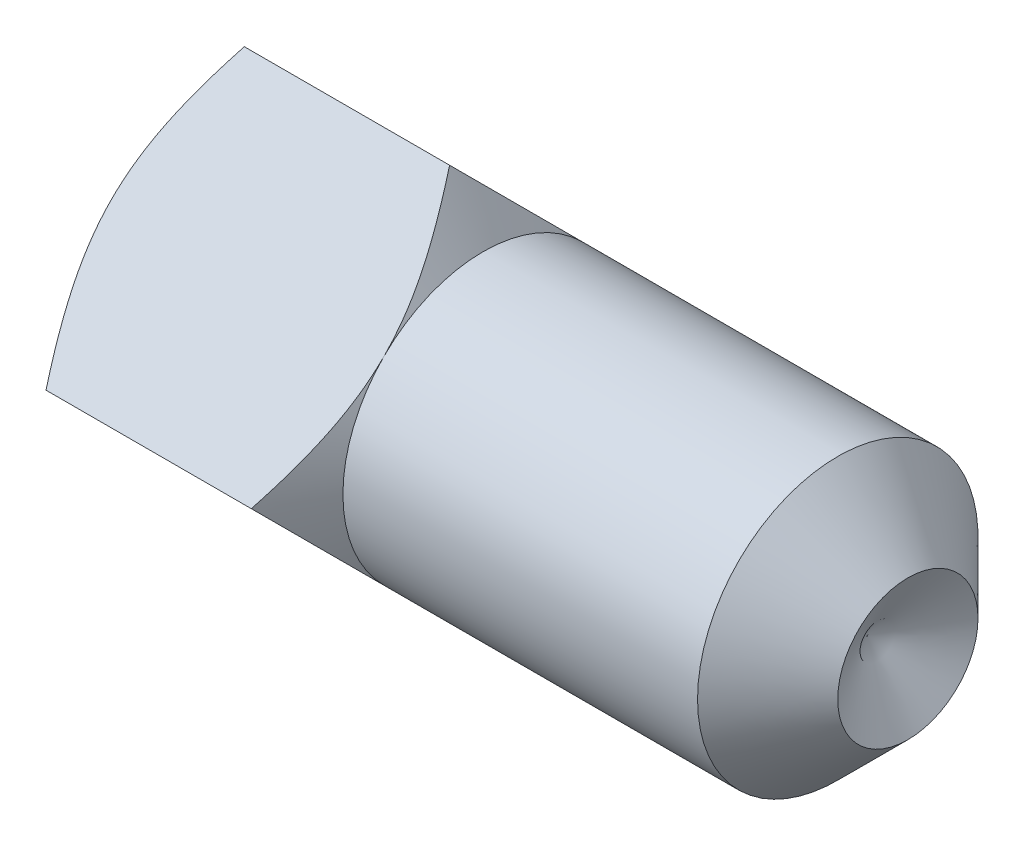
ISO-10303-21;
HEADER;
FILE_DESCRIPTION(('STEP AP214'),'2;1');
FILE_NAME('part.step','',(''),(''),'','','');
FILE_SCHEMA(('AUTOMOTIVE_DESIGN { 1 0 10303 214 1 1 1 1 }'));
ENDSEC;
DATA;
#1=APPLICATION_CONTEXT('core data for automotive mechanical design processes');
#2=APPLICATION_PROTOCOL_DEFINITION('international standard','automotive_design',2000,#1);
#3=PRODUCT_CONTEXT('',#1,'mechanical');
#4=PRODUCT('Part','Part','',(#3));
#5=PRODUCT_RELATED_PRODUCT_CATEGORY('part','',(#4));
#6=PRODUCT_DEFINITION_FORMATION('','',#4);
#7=PRODUCT_DEFINITION_CONTEXT('part definition',#1,'design');
#8=PRODUCT_DEFINITION('design','',#6,#7);
#9=PRODUCT_DEFINITION_SHAPE('','',#8);
#10=(LENGTH_UNIT() NAMED_UNIT(*) SI_UNIT(.MILLI.,.METRE.));
#11=(NAMED_UNIT(*) PLANE_ANGLE_UNIT() SI_UNIT($,.RADIAN.));
#12=(NAMED_UNIT(*) SI_UNIT($,.STERADIAN.) SOLID_ANGLE_UNIT());
#13=UNCERTAINTY_MEASURE_WITH_UNIT(LENGTH_MEASURE(1.E-05),#10,'distance_accuracy_value','');
#14=(GEOMETRIC_REPRESENTATION_CONTEXT(3) GLOBAL_UNCERTAINTY_ASSIGNED_CONTEXT((#13)) GLOBAL_UNIT_ASSIGNED_CONTEXT((#10,
#11,#12)) REPRESENTATION_CONTEXT('',''));
#15=CARTESIAN_POINT('',(0.,0.,0.));
#16=DIRECTION('',(0.,0.,1.));
#17=DIRECTION('',(1.,0.,0.));
#18=AXIS2_PLACEMENT_3D('',#15,#16,#17);
#19=CARTESIAN_POINT('',(0.,0.,0.));
#20=DIRECTION('',(-1.,0.,0.));
#21=DIRECTION('',(0.,0.,1.));
#22=AXIS2_PLACEMENT_3D('',#19,#20,#21);
#23=CYLINDRICAL_SURFACE('',#22,2.);
#24=CARTESIAN_POINT('',(3.94226497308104,0.,0.));
#25=DIRECTION('',(-1.,0.,0.));
#26=DIRECTION('',(0.,0.,1.));
#27=AXIS2_PLACEMENT_3D('',#24,#25,#26);
#28=CIRCLE('',#27,2.);
#29=CARTESIAN_POINT('',(3.9422649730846,1.41421356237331,1.41421356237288));
#30=VERTEX_POINT('',#29);
#31=CARTESIAN_POINT('',(3.94226497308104,1.41421356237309,-1.4142135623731));
#32=VERTEX_POINT('',#31);
#33=EDGE_CURVE('E11',#30,#32,#28,.T.);
#34=ORIENTED_EDGE('',*,*,#33,.F.);
#35=CARTESIAN_POINT('',(3.94226497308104,-1.41421356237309,1.4142135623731));
#36=VERTEX_POINT('',#35);
#37=EDGE_CURVE('E37',#36,#30,#28,.T.);
#38=ORIENTED_EDGE('',*,*,#37,.F.);
#39=CARTESIAN_POINT('',(3.94226497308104,-1.41421356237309,-1.4142135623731));
#40=VERTEX_POINT('',#39);
#41=EDGE_CURVE('E181',#40,#36,#28,.T.);
#42=ORIENTED_EDGE('',*,*,#41,.F.);
#43=EDGE_CURVE('E42',#32,#40,#28,.T.);
#44=ORIENTED_EDGE('',*,*,#43,.F.);
#45=EDGE_LOOP('',(#34,#38,#42,#44));
#46=FACE_BOUND('',#45,.T.);
#47=CARTESIAN_POINT('',(9.00000000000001,0.,0.));
#48=DIRECTION('',(-1.,0.,0.));
#49=DIRECTION('',(0.,0.,1.));
#50=AXIS2_PLACEMENT_3D('',#47,#48,#49);
#51=CIRCLE('',#50,2.);
#52=CARTESIAN_POINT('',(9.00000000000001,0.,2.));
#53=VERTEX_POINT('',#52);
#54=EDGE_CURVE('E97',#53,#53,#51,.T.);
#55=ORIENTED_EDGE('',*,*,#54,.T.);
#56=EDGE_LOOP('',(#55));
#57=FACE_BOUND('',#56,.T.);
#58=ADVANCED_FACE('F32',(#46,#57),#23,.T.);
#59=CARTESIAN_POINT('',(3.46397234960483,0.,0.));
#60=DIRECTION('',(-1.,0.,0.));
#61=DIRECTION('',(0.,0.,1.));
#62=AXIS2_PLACEMENT_3D('',#59,#60,#61);
#63=CONICAL_SURFACE('',#62,2.82842712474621,1.0471975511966);
#64=CARTESIAN_POINT('',(3.4638568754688,2.8286271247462,-0.000200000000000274));
#65=CARTESIAN_POINT('',(3.49161506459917,2.78053478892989,0.0478923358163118));
#66=CARTESIAN_POINT('',(3.51878504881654,2.7322683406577,0.0961587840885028));
#67=CARTESIAN_POINT('',(3.57167045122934,2.63532015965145,0.193106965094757));
#68=CARTESIAN_POINT('',(3.59738536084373,2.58663828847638,0.241788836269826));
#69=CARTESIAN_POINT('',(3.64721601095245,2.48852382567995,0.339903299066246));
#70=CARTESIAN_POINT('',(3.67132090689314,2.43908845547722,0.389338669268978));
#71=CARTESIAN_POINT('',(3.71737604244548,2.33972512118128,0.488702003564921));
#72=CARTESIAN_POINT('',(3.73932646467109,2.28979719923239,0.538629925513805));
#73=CARTESIAN_POINT('',(3.8006124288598,2.14090389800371,0.687523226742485));
#74=CARTESIAN_POINT('',(3.83626445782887,2.04114820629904,0.787278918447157));
#75=CARTESIAN_POINT('',(3.89354790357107,1.83980995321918,0.988617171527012));
#76=CARTESIAN_POINT('',(3.91521440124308,1.73823262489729,1.0901944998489));
#77=CARTESIAN_POINT('',(3.93895616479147,1.55061877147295,1.27780835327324));
#78=CARTESIAN_POINT('',(3.94365263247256,1.46475280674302,1.36367431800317));
#79=CARTESIAN_POINT('',(3.94015885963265,1.29311675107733,1.53531037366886));
#80=CARTESIAN_POINT('',(3.93196285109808,1.20734672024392,1.62108040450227));
#81=CARTESIAN_POINT('',(3.90378450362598,1.03666151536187,1.79176560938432));
#82=CARTESIAN_POINT('',(3.88378039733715,0.951748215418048,1.87667890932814));
#83=CARTESIAN_POINT('',(3.83421705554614,0.783348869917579,2.04507825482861));
#84=CARTESIAN_POINT('',(3.80465560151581,0.699863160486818,2.12856396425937));
#85=CARTESIAN_POINT('',(3.75037319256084,0.564467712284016,2.26395941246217));
#86=CARTESIAN_POINT('',(3.72780043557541,0.512114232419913,2.31631289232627));
#87=CARTESIAN_POINT('',(3.68024330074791,0.407975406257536,2.42045171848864));
#88=CARTESIAN_POINT('',(3.65525964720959,0.356189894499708,2.47223723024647));
#89=CARTESIAN_POINT('',(3.60344889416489,0.253386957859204,2.57504016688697));
#90=CARTESIAN_POINT('',(3.57663195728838,0.202366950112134,2.62606017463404));
#91=CARTESIAN_POINT('',(3.52137669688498,0.100767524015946,2.72765960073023));
#92=CARTESIAN_POINT('',(3.49293839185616,0.0501881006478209,2.77823902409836));
#93=CARTESIAN_POINT('',(3.46385687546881,-0.000200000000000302,2.82862712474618));
#94=B_SPLINE_CURVE_WITH_KNOTS('',3,(#64,#65,#66,#67,#68,#69,#70,#71,#72,#73,#74,#75,#76,#77,#78,
#79,#80,#81,#82,#83,#84,#85,#86,#87,#88,#89,#90,#91,#92,#93),.UNSPECIFIED.,.F.,.F.,(4,2,2,2,2,2,
2,2,2,2,2,2,2,2,4),(0.,0.220383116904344,0.440842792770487,0.662662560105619,0.884463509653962,
1.32047426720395,1.75538705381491,2.11928790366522,2.48335160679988,2.84808853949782,
3.21291019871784,3.4450819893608,3.67718424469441,3.90809048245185,4.13899408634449),.UNSPECIFIED.);
#95=CARTESIAN_POINT('',(3.46397234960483,2.82842712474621,0.));
#96=VERTEX_POINT('',#95);
#97=EDGE_CURVE('E141',#96,#30,#94,.T.);
#98=ORIENTED_EDGE('',*,*,#97,.T.);
#99=ORIENTED_EDGE('',*,*,#33,.T.);
#100=CARTESIAN_POINT('',(3.46385687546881,-0.000200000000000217,-2.82862712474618));
#101=CARTESIAN_POINT('',(3.49161506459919,0.0478923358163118,-2.78053478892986));
#102=CARTESIAN_POINT('',(3.51878504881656,0.0961587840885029,-2.73226834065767));
#103=CARTESIAN_POINT('',(3.57167045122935,0.193106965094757,-2.63532015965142));
#104=CARTESIAN_POINT('',(3.59738536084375,0.241788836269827,-2.58663828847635));
#105=CARTESIAN_POINT('',(3.64721601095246,0.339903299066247,-2.48852382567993));
#106=CARTESIAN_POINT('',(3.67132090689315,0.389338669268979,-2.4390884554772));
#107=CARTESIAN_POINT('',(3.71737604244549,0.488702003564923,-2.33972512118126));
#108=CARTESIAN_POINT('',(3.7393264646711,0.538629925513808,-2.28979719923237));
#109=CARTESIAN_POINT('',(3.80061242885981,0.687523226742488,-2.1409038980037));
#110=CARTESIAN_POINT('',(3.83626445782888,0.78727891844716,-2.04114820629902));
#111=CARTESIAN_POINT('',(3.89354790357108,0.988617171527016,-1.83980995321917));
#112=CARTESIAN_POINT('',(3.91521440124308,1.0901944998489,-1.73823262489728));
#113=CARTESIAN_POINT('',(3.93895616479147,1.27780835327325,-1.55061877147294));
#114=CARTESIAN_POINT('',(3.94365263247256,1.36367431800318,-1.46475280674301));
#115=CARTESIAN_POINT('',(3.94015885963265,1.53531037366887,-1.29311675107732));
#116=CARTESIAN_POINT('',(3.93196285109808,1.62108040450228,-1.20734672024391));
#117=CARTESIAN_POINT('',(3.90378450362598,1.79176560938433,-1.03666151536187));
#118=CARTESIAN_POINT('',(3.88378039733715,1.87667890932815,-0.951748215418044));
#119=CARTESIAN_POINT('',(3.83421705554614,2.04507825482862,-0.783348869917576));
#120=CARTESIAN_POINT('',(3.8046556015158,2.12856396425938,-0.699863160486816));
#121=CARTESIAN_POINT('',(3.75037319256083,2.26395941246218,-0.564467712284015));
#122=CARTESIAN_POINT('',(3.7278004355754,2.31631289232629,-0.512114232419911));
#123=CARTESIAN_POINT('',(3.6802433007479,2.42045171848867,-0.407975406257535));
#124=CARTESIAN_POINT('',(3.65525964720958,2.47223723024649,-0.356189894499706));
#125=CARTESIAN_POINT('',(3.60344889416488,2.575040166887,-0.253386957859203));
#126=CARTESIAN_POINT('',(3.57663195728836,2.62606017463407,-0.202366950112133));
#127=CARTESIAN_POINT('',(3.52137669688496,2.72765960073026,-0.100767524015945));
#128=CARTESIAN_POINT('',(3.49293839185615,2.77823902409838,-0.0501881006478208));
#129=CARTESIAN_POINT('',(3.4638568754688,2.8286271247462,0.000200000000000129));
#130=B_SPLINE_CURVE_WITH_KNOTS('',3,(#100,#101,#102,#103,#104,#105,#106,#107,#108,#109,#110,
#111,#112,#113,#114,#115,#116,#117,#118,#119,#120,#121,#122,#123,#124,#125,#126,#127,#128,#129),
.UNSPECIFIED.,.F.,.F.,(4,2,2,2,2,2,2,2,2,2,2,2,2,2,4),(0.,0.220383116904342,0.440842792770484,
0.662662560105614,0.884463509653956,1.32047426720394,1.75538705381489,2.11928790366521,
2.48335160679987,2.84808853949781,3.21291019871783,3.4450819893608,3.67718424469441,
3.90809048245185,4.13899408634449),.UNSPECIFIED.);
#131=EDGE_CURVE('E100',#32,#96,#130,.T.);
#132=ORIENTED_EDGE('',*,*,#131,.T.);
#133=EDGE_LOOP('',(#98,#99,#132));
#134=FACE_BOUND('',#133,.T.);
#135=ADVANCED_FACE('F119',(#134),#63,.T.);
#136=CARTESIAN_POINT('',(3.46397234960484,0.,-2.82842712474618));
#137=VERTEX_POINT('',#136);
#138=EDGE_CURVE('E103',#137,#32,#130,.T.);
#139=ORIENTED_EDGE('',*,*,#138,.T.);
#140=ORIENTED_EDGE('',*,*,#43,.T.);
#141=CARTESIAN_POINT('',(3.4638568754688,-2.8286271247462,0.000199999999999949));
#142=CARTESIAN_POINT('',(3.49161506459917,-2.78053478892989,-0.0478923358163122));
#143=CARTESIAN_POINT('',(3.51878504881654,-2.7322683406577,-0.0961587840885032));
#144=CARTESIAN_POINT('',(3.57167045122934,-2.63532015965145,-0.193106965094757));
#145=CARTESIAN_POINT('',(3.59738536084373,-2.58663828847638,-0.241788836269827));
#146=CARTESIAN_POINT('',(3.64721601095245,-2.48852382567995,-0.339903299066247));
#147=CARTESIAN_POINT('',(3.67132090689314,-2.43908845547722,-0.389338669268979));
#148=CARTESIAN_POINT('',(3.71737604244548,-2.33972512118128,-0.488702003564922));
#149=CARTESIAN_POINT('',(3.73932646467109,-2.28979719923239,-0.538629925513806));
#150=CARTESIAN_POINT('',(3.8006124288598,-2.14090389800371,-0.687523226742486));
#151=CARTESIAN_POINT('',(3.83626445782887,-2.04114820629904,-0.787278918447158));
#152=CARTESIAN_POINT('',(3.89354790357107,-1.83980995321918,-0.988617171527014));
#153=CARTESIAN_POINT('',(3.91521440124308,-1.73823262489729,-1.0901944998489));
#154=CARTESIAN_POINT('',(3.93895616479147,-1.55061877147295,-1.27780835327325));
#155=CARTESIAN_POINT('',(3.94365263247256,-1.46475280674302,-1.36367431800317));
#156=CARTESIAN_POINT('',(3.94015885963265,-1.29311675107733,-1.53531037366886));
#157=CARTESIAN_POINT('',(3.93196285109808,-1.20734672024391,-1.62108040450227));
#158=CARTESIAN_POINT('',(3.90378450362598,-1.03666151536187,-1.79176560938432));
#159=CARTESIAN_POINT('',(3.88378039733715,-0.951748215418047,-1.87667890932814));
#160=CARTESIAN_POINT('',(3.83421705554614,-0.783348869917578,-2.04507825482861));
#161=CARTESIAN_POINT('',(3.80465560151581,-0.699863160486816,-2.12856396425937));
#162=CARTESIAN_POINT('',(3.75037319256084,-0.564467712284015,-2.26395941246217));
#163=CARTESIAN_POINT('',(3.72780043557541,-0.512114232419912,-2.31631289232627));
#164=CARTESIAN_POINT('',(3.68024330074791,-0.407975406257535,-2.42045171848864));
#165=CARTESIAN_POINT('',(3.65525964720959,-0.356189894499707,-2.47223723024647));
#166=CARTESIAN_POINT('',(3.60344889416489,-0.253386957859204,-2.57504016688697));
#167=CARTESIAN_POINT('',(3.57663195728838,-0.202366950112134,-2.62606017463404));
#168=CARTESIAN_POINT('',(3.52137669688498,-0.100767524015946,-2.72765960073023));
#169=CARTESIAN_POINT('',(3.49293839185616,-0.0501881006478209,-2.77823902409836));
#170=CARTESIAN_POINT('',(3.46385687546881,0.000200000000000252,-2.82862712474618));
#171=B_SPLINE_CURVE_WITH_KNOTS('',3,(#141,#142,#143,#144,#145,#146,#147,#148,#149,#150,#151,
#152,#153,#154,#155,#156,#157,#158,#159,#160,#161,#162,#163,#164,#165,#166,#167,#168,#169,#170),
.UNSPECIFIED.,.F.,.F.,(4,2,2,2,2,2,2,2,2,2,2,2,2,2,4),(0.,0.220383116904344,0.440842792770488,
0.66266256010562,0.884463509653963,1.32047426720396,1.75538705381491,2.11928790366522,
2.48335160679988,2.84808853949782,3.21291019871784,3.44508198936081,3.67718424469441,
3.90809048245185,4.13899408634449),.UNSPECIFIED.);
#172=EDGE_CURVE('E55',#40,#137,#171,.T.);
#173=ORIENTED_EDGE('',*,*,#172,.T.);
#174=EDGE_LOOP('',(#139,#140,#173));
#175=FACE_BOUND('',#174,.T.);
#176=ADVANCED_FACE('F124',(#175),#63,.T.);
#177=CARTESIAN_POINT('',(3.46397234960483,-2.82842712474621,0.));
#178=VERTEX_POINT('',#177);
#179=EDGE_CURVE('E110',#178,#40,#171,.T.);
#180=ORIENTED_EDGE('',*,*,#179,.T.);
#181=ORIENTED_EDGE('',*,*,#41,.T.);
#182=CARTESIAN_POINT('',(3.46385687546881,0.000199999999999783,2.82862712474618));
#183=CARTESIAN_POINT('',(3.49161506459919,-0.0478923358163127,2.78053478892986));
#184=CARTESIAN_POINT('',(3.51878504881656,-0.0961587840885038,2.73226834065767));
#185=CARTESIAN_POINT('',(3.57167045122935,-0.193106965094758,2.63532015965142));
#186=CARTESIAN_POINT('',(3.59738536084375,-0.241788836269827,2.58663828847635));
#187=CARTESIAN_POINT('',(3.64721601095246,-0.339903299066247,2.48852382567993));
#188=CARTESIAN_POINT('',(3.67132090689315,-0.38933866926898,2.4390884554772));
#189=CARTESIAN_POINT('',(3.71737604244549,-0.488702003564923,2.33972512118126));
#190=CARTESIAN_POINT('',(3.7393264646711,-0.538629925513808,2.28979719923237));
#191=CARTESIAN_POINT('',(3.80061242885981,-0.687523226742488,2.1409038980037));
#192=CARTESIAN_POINT('',(3.83626445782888,-0.787278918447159,2.04114820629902));
#193=CARTESIAN_POINT('',(3.89354790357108,-0.988617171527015,1.83980995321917));
#194=CARTESIAN_POINT('',(3.91521440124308,-1.0901944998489,1.73823262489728));
#195=CARTESIAN_POINT('',(3.93895616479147,-1.27780835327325,1.55061877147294));
#196=CARTESIAN_POINT('',(3.94365263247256,-1.36367431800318,1.46475280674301));
#197=CARTESIAN_POINT('',(3.94015885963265,-1.53531037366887,1.29311675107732));
#198=CARTESIAN_POINT('',(3.93196285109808,-1.62108040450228,1.20734672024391));
#199=CARTESIAN_POINT('',(3.90378450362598,-1.79176560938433,1.03666151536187));
#200=CARTESIAN_POINT('',(3.88378039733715,-1.87667890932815,0.951748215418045));
#201=CARTESIAN_POINT('',(3.83421705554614,-2.04507825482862,0.783348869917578));
#202=CARTESIAN_POINT('',(3.8046556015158,-2.12856396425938,0.699863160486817));
#203=CARTESIAN_POINT('',(3.75037319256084,-2.26395941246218,0.564467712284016));
#204=CARTESIAN_POINT('',(3.7278004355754,-2.31631289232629,0.512114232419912));
#205=CARTESIAN_POINT('',(3.6802433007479,-2.42045171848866,0.407975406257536));
#206=CARTESIAN_POINT('',(3.65525964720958,-2.47223723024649,0.356189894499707));
#207=CARTESIAN_POINT('',(3.60344889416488,-2.575040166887,0.253386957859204));
#208=CARTESIAN_POINT('',(3.57663195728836,-2.62606017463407,0.202366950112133));
#209=CARTESIAN_POINT('',(3.52137669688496,-2.72765960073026,0.100767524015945));
#210=CARTESIAN_POINT('',(3.49293839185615,-2.77823902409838,0.0501881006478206));
#211=CARTESIAN_POINT('',(3.4638568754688,-2.8286271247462,-0.000200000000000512));
#212=B_SPLINE_CURVE_WITH_KNOTS('',3,(#182,#183,#184,#185,#186,#187,#188,#189,#190,#191,#192,
#193,#194,#195,#196,#197,#198,#199,#200,#201,#202,#203,#204,#205,#206,#207,#208,#209,#210,#211),
.UNSPECIFIED.,.F.,.F.,(4,2,2,2,2,2,2,2,2,2,2,2,2,2,4),(0.,0.220383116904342,0.440842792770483,
0.662662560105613,0.884463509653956,1.32047426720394,1.75538705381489,2.1192879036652,
2.48335160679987,2.8480885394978,3.21291019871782,3.4450819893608,3.67718424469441,
3.90809048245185,4.13899408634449),.UNSPECIFIED.);
#213=EDGE_CURVE('E140',#36,#178,#212,.T.);
#214=ORIENTED_EDGE('',*,*,#213,.T.);
#215=EDGE_LOOP('',(#180,#181,#214));
#216=FACE_BOUND('',#215,.T.);
#217=ADVANCED_FACE('F193',(#216),#63,.T.);
#218=CARTESIAN_POINT('',(3.46397234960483,0.,2.82842712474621));
#219=VERTEX_POINT('',#218);
#220=EDGE_CURVE('E134',#219,#36,#212,.T.);
#221=ORIENTED_EDGE('',*,*,#220,.T.);
#222=ORIENTED_EDGE('',*,*,#37,.T.);
#223=EDGE_CURVE('E139',#30,#219,#94,.T.);
#224=ORIENTED_EDGE('',*,*,#223,.T.);
#225=EDGE_LOOP('',(#221,#222,#224));
#226=FACE_BOUND('',#225,.T.);
#227=ADVANCED_FACE('F126',(#226),#63,.T.);
#228=CARTESIAN_POINT('',(4.,2.8284271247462,0.));
#229=DIRECTION('',(0.,-0.707106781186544,-0.707106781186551));
#230=DIRECTION('',(0.,0.707106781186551,-0.707106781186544));
#231=AXIS2_PLACEMENT_3D('',#228,#229,#230);
#232=PLANE('',#231);
#233=ORIENTED_EDGE('',*,*,#223,.F.);
#234=ORIENTED_EDGE('',*,*,#97,.F.);
#235=DIRECTION('',(-1.,0.,0.));
#236=VECTOR('',#235,1.);
#237=CARTESIAN_POINT('',(4.,2.8284271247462,0.));
#238=LINE('',#237,#236);
#239=CARTESIAN_POINT('',(0.536027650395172,2.8284271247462,0.));
#240=VERTEX_POINT('',#239);
#241=EDGE_CURVE('E172',#96,#240,#238,.T.);
#242=ORIENTED_EDGE('',*,*,#241,.T.);
#243=CARTESIAN_POINT('',(0.536143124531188,-0.000200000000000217,2.82862712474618));
#244=CARTESIAN_POINT('',(0.508384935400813,0.0478923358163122,2.78053478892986));
#245=CARTESIAN_POINT('',(0.481214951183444,0.0961587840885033,2.73226834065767));
#246=CARTESIAN_POINT('',(0.428329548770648,0.193106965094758,2.63532015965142));
#247=CARTESIAN_POINT('',(0.402614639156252,0.241788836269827,2.58663828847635));
#248=CARTESIAN_POINT('',(0.352783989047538,0.339903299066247,2.48852382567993));
#249=CARTESIAN_POINT('',(0.328679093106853,0.389338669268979,2.4390884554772));
#250=CARTESIAN_POINT('',(0.282623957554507,0.488702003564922,2.33972512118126));
#251=CARTESIAN_POINT('',(0.260673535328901,0.538629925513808,2.28979719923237));
#252=CARTESIAN_POINT('',(0.199387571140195,0.687523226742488,2.1409038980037));
#253=CARTESIAN_POINT('',(0.163735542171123,0.787278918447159,2.04114820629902));
#254=CARTESIAN_POINT('',(0.106452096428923,0.988617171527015,1.83980995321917));
#255=CARTESIAN_POINT('',(0.0847855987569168,1.0901944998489,1.73823262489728));
#256=CARTESIAN_POINT('',(0.0610438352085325,1.27780835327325,1.55061877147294));
#257=CARTESIAN_POINT('',(0.0563473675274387,1.36367431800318,1.46475280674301));
#258=CARTESIAN_POINT('',(0.0598411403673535,1.53531037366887,1.29311675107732));
#259=CARTESIAN_POINT('',(0.0680371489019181,1.62108040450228,1.20734672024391));
#260=CARTESIAN_POINT('',(0.0962154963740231,1.79176560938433,1.03666151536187));
#261=CARTESIAN_POINT('',(0.116219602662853,1.87667890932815,0.951748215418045));
#262=CARTESIAN_POINT('',(0.165782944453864,2.04507825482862,0.783348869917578));
#263=CARTESIAN_POINT('',(0.195344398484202,2.12856396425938,0.699863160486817));
#264=CARTESIAN_POINT('',(0.249626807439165,2.26395941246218,0.564467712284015));
#265=CARTESIAN_POINT('',(0.272199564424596,2.31631289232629,0.512114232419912));
#266=CARTESIAN_POINT('',(0.319756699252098,2.42045171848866,0.407975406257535));
#267=CARTESIAN_POINT('',(0.344740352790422,2.47223723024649,0.356189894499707));
#268=CARTESIAN_POINT('',(0.396551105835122,2.575040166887,0.253386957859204));
#269=CARTESIAN_POINT('',(0.423368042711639,2.62606017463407,0.202366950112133));
#270=CARTESIAN_POINT('',(0.478623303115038,2.72765960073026,0.100767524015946));
#271=CARTESIAN_POINT('',(0.507061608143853,2.77823902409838,0.050188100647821));
#272=CARTESIAN_POINT('',(0.536143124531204,2.8286271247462,-0.000200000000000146));
#273=B_SPLINE_CURVE_WITH_KNOTS('',3,(#243,#244,#245,#246,#247,#248,#249,#250,#251,#252,#253,
#254,#255,#256,#257,#258,#259,#260,#261,#262,#263,#264,#265,#266,#267,#268,#269,#270,#271,#272),
.UNSPECIFIED.,.F.,.F.,(4,2,2,2,2,2,2,2,2,2,2,2,2,2,4),(0.,0.220383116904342,0.440842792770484,
0.662662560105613,0.884463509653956,1.32047426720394,1.75538705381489,2.11928790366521,
2.48335160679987,2.8480885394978,3.21291019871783,3.4450819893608,3.67718424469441,
3.90809048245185,4.13899408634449),.UNSPECIFIED.);
#274=CARTESIAN_POINT('',(0.536027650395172,0.,2.8284271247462));
#275=VERTEX_POINT('',#274);
#276=EDGE_CURVE('E161',#275,#240,#273,.T.);
#277=ORIENTED_EDGE('',*,*,#276,.F.);
#278=DIRECTION('',(-1.,0.,0.));
#279=VECTOR('',#278,1.);
#280=CARTESIAN_POINT('',(4.,0.,2.82842712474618));
#281=LINE('',#280,#279);
#282=EDGE_CURVE('E177',#219,#275,#281,.T.);
#283=ORIENTED_EDGE('',*,*,#282,.F.);
#284=EDGE_LOOP('',(#233,#234,#242,#277,#283));
#285=FACE_BOUND('',#284,.T.);
#286=ADVANCED_FACE('F34',(#285),#232,.F.);
#287=CARTESIAN_POINT('',(4.,-2.8284271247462,0.));
#288=DIRECTION('',(0.,0.707106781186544,-0.707106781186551));
#289=DIRECTION('',(0.,0.707106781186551,0.707106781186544));
#290=AXIS2_PLACEMENT_3D('',#287,#288,#289);
#291=PLANE('',#290);
#292=ORIENTED_EDGE('',*,*,#213,.F.);
#293=ORIENTED_EDGE('',*,*,#220,.F.);
#294=ORIENTED_EDGE('',*,*,#282,.T.);
#295=CARTESIAN_POINT('',(0.536143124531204,-2.8286271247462,-0.000200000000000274));
#296=CARTESIAN_POINT('',(0.508384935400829,-2.78053478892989,0.0478923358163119));
#297=CARTESIAN_POINT('',(0.481214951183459,-2.7322683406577,0.0961587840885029));
#298=CARTESIAN_POINT('',(0.428329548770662,-2.63532015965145,0.193106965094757));
#299=CARTESIAN_POINT('',(0.402614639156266,-2.58663828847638,0.241788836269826));
#300=CARTESIAN_POINT('',(0.352783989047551,-2.48852382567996,0.339903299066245));
#301=CARTESIAN_POINT('',(0.328679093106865,-2.43908845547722,0.389338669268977));
#302=CARTESIAN_POINT('',(0.282623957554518,-2.33972512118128,0.48870200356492));
#303=CARTESIAN_POINT('',(0.260673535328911,-2.28979719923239,0.538629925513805));
#304=CARTESIAN_POINT('',(0.199387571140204,-2.14090389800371,0.687523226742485));
#305=CARTESIAN_POINT('',(0.16373554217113,-2.04114820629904,0.787278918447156));
#306=CARTESIAN_POINT('',(0.106452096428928,-1.83980995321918,0.988617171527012));
#307=CARTESIAN_POINT('',(0.0847855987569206,-1.73823262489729,1.0901944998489));
#308=CARTESIAN_POINT('',(0.0610438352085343,-1.55061877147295,1.27780835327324));
#309=CARTESIAN_POINT('',(0.0563473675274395,-1.46475280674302,1.36367431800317));
#310=CARTESIAN_POINT('',(0.0598411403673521,-1.29311675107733,1.53531037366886));
#311=CARTESIAN_POINT('',(0.0680371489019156,-1.20734672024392,1.62108040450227));
#312=CARTESIAN_POINT('',(0.0962154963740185,-1.03666151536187,1.79176560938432));
#313=CARTESIAN_POINT('',(0.116219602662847,-0.951748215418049,1.87667890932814));
#314=CARTESIAN_POINT('',(0.165782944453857,-0.78334886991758,2.0450782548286));
#315=CARTESIAN_POINT('',(0.195344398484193,-0.699863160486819,2.12856396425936));
#316=CARTESIAN_POINT('',(0.249626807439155,-0.564467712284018,2.26395941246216));
#317=CARTESIAN_POINT('',(0.272199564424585,-0.512114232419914,2.31631289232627));
#318=CARTESIAN_POINT('',(0.319756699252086,-0.407975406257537,2.42045171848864));
#319=CARTESIAN_POINT('',(0.34474035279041,-0.356189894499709,2.47223723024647));
#320=CARTESIAN_POINT('',(0.396551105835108,-0.253386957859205,2.57504016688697));
#321=CARTESIAN_POINT('',(0.423368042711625,-0.202366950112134,2.62606017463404));
#322=CARTESIAN_POINT('',(0.478623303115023,-0.100767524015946,2.72765960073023));
#323=CARTESIAN_POINT('',(0.507061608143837,-0.0501881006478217,2.77823902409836));
#324=CARTESIAN_POINT('',(0.536143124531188,0.000200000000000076,2.82862712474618));
#325=B_SPLINE_CURVE_WITH_KNOTS('',3,(#295,#296,#297,#298,#299,#300,#301,#302,#303,#304,#305,
#306,#307,#308,#309,#310,#311,#312,#313,#314,#315,#316,#317,#318,#319,#320,#321,#322,#323,#324),
.UNSPECIFIED.,.F.,.F.,(4,2,2,2,2,2,2,2,2,2,2,2,2,2,4),(0.,0.220383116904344,0.440842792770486,
0.662662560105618,0.884463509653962,1.32047426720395,1.75538705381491,2.11928790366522,
2.48335160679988,2.84808853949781,3.21291019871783,3.4450819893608,3.67718424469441,
3.90809048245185,4.13899408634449),.UNSPECIFIED.);
#326=CARTESIAN_POINT('',(0.536027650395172,-2.8284271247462,0.));
#327=VERTEX_POINT('',#326);
#328=EDGE_CURVE('E154',#327,#275,#325,.T.);
#329=ORIENTED_EDGE('',*,*,#328,.F.);
#330=DIRECTION('',(-1.,0.,0.));
#331=VECTOR('',#330,1.);
#332=CARTESIAN_POINT('',(4.,-2.8284271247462,0.));
#333=LINE('',#332,#331);
#334=EDGE_CURVE('E176',#178,#327,#333,.T.);
#335=ORIENTED_EDGE('',*,*,#334,.F.);
#336=EDGE_LOOP('',(#292,#293,#294,#329,#335));
#337=FACE_BOUND('',#336,.T.);
#338=ADVANCED_FACE('F146',(#337),#291,.F.);
#339=CARTESIAN_POINT('',(4.,-2.8284271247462,0.));
#340=DIRECTION('',(0.,0.707106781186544,0.707106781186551));
#341=DIRECTION('',(0.,-0.707106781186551,0.707106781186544));
#342=AXIS2_PLACEMENT_3D('',#339,#340,#341);
#343=PLANE('',#342);
#344=ORIENTED_EDGE('',*,*,#172,.F.);
#345=ORIENTED_EDGE('',*,*,#179,.F.);
#346=ORIENTED_EDGE('',*,*,#334,.T.);
#347=CARTESIAN_POINT('',(0.536143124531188,0.000199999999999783,-2.82862712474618));
#348=CARTESIAN_POINT('',(0.508384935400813,-0.0478923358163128,-2.78053478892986));
#349=CARTESIAN_POINT('',(0.481214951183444,-0.0961587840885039,-2.73226834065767));
#350=CARTESIAN_POINT('',(0.428329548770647,-0.193106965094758,-2.63532015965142));
#351=CARTESIAN_POINT('',(0.402614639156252,-0.241788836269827,-2.58663828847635));
#352=CARTESIAN_POINT('',(0.352783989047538,-0.339903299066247,-2.48852382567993));
#353=CARTESIAN_POINT('',(0.328679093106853,-0.38933866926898,-2.4390884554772));
#354=CARTESIAN_POINT('',(0.282623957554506,-0.488702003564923,-2.33972512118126));
#355=CARTESIAN_POINT('',(0.2606735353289,-0.538629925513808,-2.28979719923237));
#356=CARTESIAN_POINT('',(0.199387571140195,-0.687523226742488,-2.1409038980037));
#357=CARTESIAN_POINT('',(0.163735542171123,-0.787278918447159,-2.04114820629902));
#358=CARTESIAN_POINT('',(0.106452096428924,-0.988617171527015,-1.83980995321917));
#359=CARTESIAN_POINT('',(0.0847855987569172,-1.0901944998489,-1.73823262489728));
#360=CARTESIAN_POINT('',(0.0610438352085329,-1.27780835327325,-1.55061877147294));
#361=CARTESIAN_POINT('',(0.0563473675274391,-1.36367431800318,-1.46475280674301));
#362=CARTESIAN_POINT('',(0.0598411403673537,-1.53531037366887,-1.29311675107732));
#363=CARTESIAN_POINT('',(0.0680371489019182,-1.62108040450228,-1.20734672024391));
#364=CARTESIAN_POINT('',(0.0962154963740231,-1.79176560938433,-1.03666151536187));
#365=CARTESIAN_POINT('',(0.116219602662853,-1.87667890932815,-0.951748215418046));
#366=CARTESIAN_POINT('',(0.165782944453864,-2.04507825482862,-0.783348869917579));
#367=CARTESIAN_POINT('',(0.195344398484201,-2.12856396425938,-0.699863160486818));
#368=CARTESIAN_POINT('',(0.249626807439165,-2.26395941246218,-0.564467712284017));
#369=CARTESIAN_POINT('',(0.272199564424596,-2.31631289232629,-0.512114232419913));
#370=CARTESIAN_POINT('',(0.319756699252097,-2.42045171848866,-0.407975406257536));
#371=CARTESIAN_POINT('',(0.344740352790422,-2.47223723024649,-0.356189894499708));
#372=CARTESIAN_POINT('',(0.396551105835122,-2.575040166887,-0.253386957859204));
#373=CARTESIAN_POINT('',(0.423368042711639,-2.62606017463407,-0.202366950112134));
#374=CARTESIAN_POINT('',(0.478623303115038,-2.72765960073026,-0.100767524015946));
#375=CARTESIAN_POINT('',(0.507061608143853,-2.77823902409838,-0.0501881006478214));
#376=CARTESIAN_POINT('',(0.536143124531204,-2.8286271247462,0.000199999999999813));
#377=B_SPLINE_CURVE_WITH_KNOTS('',3,(#347,#348,#349,#350,#351,#352,#353,#354,#355,#356,#357,
#358,#359,#360,#361,#362,#363,#364,#365,#366,#367,#368,#369,#370,#371,#372,#373,#374,#375,#376),
.UNSPECIFIED.,.F.,.F.,(4,2,2,2,2,2,2,2,2,2,2,2,2,2,4),(0.,0.220383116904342,0.440842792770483,
0.662662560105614,0.884463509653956,1.32047426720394,1.75538705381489,2.1192879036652,
2.48335160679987,2.8480885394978,3.21291019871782,3.4450819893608,3.6771842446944,
3.90809048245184,4.13899408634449),.UNSPECIFIED.);
#378=CARTESIAN_POINT('',(0.536027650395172,0.,-2.8284271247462));
#379=VERTEX_POINT('',#378);
#380=EDGE_CURVE('E162',#379,#327,#377,.T.);
#381=ORIENTED_EDGE('',*,*,#380,.F.);
#382=DIRECTION('',(-1.,0.,0.));
#383=VECTOR('',#382,1.);
#384=CARTESIAN_POINT('',(4.,0.,-2.82842712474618));
#385=LINE('',#384,#383);
#386=EDGE_CURVE('E174',#137,#379,#385,.T.);
#387=ORIENTED_EDGE('',*,*,#386,.F.);
#388=EDGE_LOOP('',(#344,#345,#346,#381,#387));
#389=FACE_BOUND('',#388,.T.);
#390=ADVANCED_FACE('F149',(#389),#343,.F.);
#391=CARTESIAN_POINT('',(4.,2.8284271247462,0.));
#392=DIRECTION('',(0.,-0.707106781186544,0.707106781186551));
#393=DIRECTION('',(0.,-0.707106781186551,-0.707106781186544));
#394=AXIS2_PLACEMENT_3D('',#391,#392,#393);
#395=PLANE('',#394);
#396=ORIENTED_EDGE('',*,*,#131,.F.);
#397=ORIENTED_EDGE('',*,*,#138,.F.);
#398=ORIENTED_EDGE('',*,*,#386,.T.);
#399=CARTESIAN_POINT('',(0.536143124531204,2.8286271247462,0.000199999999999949));
#400=CARTESIAN_POINT('',(0.508384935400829,2.78053478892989,-0.0478923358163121));
#401=CARTESIAN_POINT('',(0.481214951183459,2.7322683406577,-0.0961587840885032));
#402=CARTESIAN_POINT('',(0.428329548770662,2.63532015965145,-0.193106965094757));
#403=CARTESIAN_POINT('',(0.402614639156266,2.58663828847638,-0.241788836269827));
#404=CARTESIAN_POINT('',(0.352783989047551,2.48852382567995,-0.339903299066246));
#405=CARTESIAN_POINT('',(0.328679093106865,2.43908845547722,-0.389338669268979));
#406=CARTESIAN_POINT('',(0.282623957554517,2.33972512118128,-0.488702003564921));
#407=CARTESIAN_POINT('',(0.260673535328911,2.28979719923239,-0.538629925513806));
#408=CARTESIAN_POINT('',(0.199387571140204,2.14090389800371,-0.687523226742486));
#409=CARTESIAN_POINT('',(0.16373554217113,2.04114820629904,-0.787278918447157));
#410=CARTESIAN_POINT('',(0.106452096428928,1.83980995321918,-0.988617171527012));
#411=CARTESIAN_POINT('',(0.0847855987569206,1.73823262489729,-1.0901944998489));
#412=CARTESIAN_POINT('',(0.0610438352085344,1.55061877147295,-1.27780835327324));
#413=CARTESIAN_POINT('',(0.0563473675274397,1.46475280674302,-1.36367431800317));
#414=CARTESIAN_POINT('',(0.0598411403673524,1.29311675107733,-1.53531037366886));
#415=CARTESIAN_POINT('',(0.0680371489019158,1.20734672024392,-1.62108040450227));
#416=CARTESIAN_POINT('',(0.0962154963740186,1.03666151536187,-1.79176560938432));
#417=CARTESIAN_POINT('',(0.116219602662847,0.951748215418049,-1.87667890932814));
#418=CARTESIAN_POINT('',(0.165782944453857,0.783348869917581,-2.0450782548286));
#419=CARTESIAN_POINT('',(0.195344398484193,0.69986316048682,-2.12856396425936));
#420=CARTESIAN_POINT('',(0.249626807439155,0.564467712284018,-2.26395941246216));
#421=CARTESIAN_POINT('',(0.272199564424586,0.512114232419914,-2.31631289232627));
#422=CARTESIAN_POINT('',(0.319756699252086,0.407975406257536,-2.42045171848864));
#423=CARTESIAN_POINT('',(0.34474035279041,0.356189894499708,-2.47223723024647));
#424=CARTESIAN_POINT('',(0.396551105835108,0.253386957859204,-2.57504016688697));
#425=CARTESIAN_POINT('',(0.423368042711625,0.202366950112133,-2.62606017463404));
#426=CARTESIAN_POINT('',(0.478623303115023,0.100767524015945,-2.72765960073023));
#427=CARTESIAN_POINT('',(0.507061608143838,0.0501881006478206,-2.77823902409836));
#428=CARTESIAN_POINT('',(0.536143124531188,-0.000200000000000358,-2.82862712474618));
#429=B_SPLINE_CURVE_WITH_KNOTS('',3,(#399,#400,#401,#402,#403,#404,#405,#406,#407,#408,#409,
#410,#411,#412,#413,#414,#415,#416,#417,#418,#419,#420,#421,#422,#423,#424,#425,#426,#427,#428),
.UNSPECIFIED.,.F.,.F.,(4,2,2,2,2,2,2,2,2,2,2,2,2,2,4),(0.,0.220383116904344,0.440842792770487,
0.662662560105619,0.884463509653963,1.32047426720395,1.75538705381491,2.11928790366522,
2.48335160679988,2.84808853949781,3.21291019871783,3.4450819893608,3.67718424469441,
3.90809048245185,4.13899408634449),.UNSPECIFIED.);
#430=EDGE_CURVE('E199',#240,#379,#429,.T.);
#431=ORIENTED_EDGE('',*,*,#430,.F.);
#432=ORIENTED_EDGE('',*,*,#241,.F.);
#433=EDGE_LOOP('',(#396,#397,#398,#431,#432));
#434=FACE_BOUND('',#433,.T.);
#435=ADVANCED_FACE('F116',(#434),#395,.F.);
#436=CARTESIAN_POINT('',(0.,0.,0.));
#437=DIRECTION('',(1.,0.,0.));
#438=DIRECTION('',(0.,0.,-1.));
#439=AXIS2_PLACEMENT_3D('',#436,#437,#438);
#440=CONICAL_SURFACE('',#439,1.9,1.0471975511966);
#441=CARTESIAN_POINT('',(0.,0.,0.));
#442=DIRECTION('',(-1.,0.,0.));
#443=DIRECTION('',(0.,0.,1.));
#444=AXIS2_PLACEMENT_3D('',#441,#442,#443);
#445=CIRCLE('',#444,1.9);
#446=CARTESIAN_POINT('',(0.,0.,1.9));
#447=VERTEX_POINT('',#446);
#448=EDGE_CURVE('E197',#447,#447,#445,.T.);
#449=ORIENTED_EDGE('',*,*,#448,.F.);
#450=EDGE_LOOP('',(#449));
#451=FACE_BOUND('',#450,.T.);
#452=ORIENTED_EDGE('',*,*,#276,.T.);
#453=ORIENTED_EDGE('',*,*,#430,.T.);
#454=ORIENTED_EDGE('',*,*,#380,.T.);
#455=ORIENTED_EDGE('',*,*,#328,.T.);
#456=EDGE_LOOP('',(#452,#453,#454,#455));
#457=FACE_BOUND('',#456,.T.);
#458=ADVANCED_FACE('F128',(#451,#457),#440,.T.);
#459=CARTESIAN_POINT('',(0.,0.,2.82842712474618));
#460=DIRECTION('',(-1.,0.,0.));
#461=DIRECTION('',(0.,0.,1.));
#462=AXIS2_PLACEMENT_3D('',#459,#460,#461);
#463=PLANE('',#462);
#464=ORIENTED_EDGE('',*,*,#448,.T.);
#465=EDGE_LOOP('',(#464));
#466=FACE_BOUND('',#465,.T.);
#467=ADVANCED_FACE('F218',(#466),#463,.T.);
#468=CARTESIAN_POINT('',(9.00000000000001,0.,0.));
#469=DIRECTION('',(-1.,0.,0.));
#470=DIRECTION('',(0.,0.,1.));
#471=AXIS2_PLACEMENT_3D('',#468,#469,#470);
#472=CONICAL_SURFACE('',#471,2.,0.785398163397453);
#473=CARTESIAN_POINT('',(10.,0.,0.));
#474=DIRECTION('',(-1.,0.,0.));
#475=DIRECTION('',(0.,0.,1.));
#476=AXIS2_PLACEMENT_3D('',#473,#474,#475);
#477=CIRCLE('',#476,1.);
#478=CARTESIAN_POINT('',(10.,0.,1.));
#479=VERTEX_POINT('',#478);
#480=EDGE_CURVE('E95',#479,#479,#477,.T.);
#481=ORIENTED_EDGE('',*,*,#480,.T.);
#482=EDGE_LOOP('',(#481));
#483=FACE_BOUND('',#482,.T.);
#484=ORIENTED_EDGE('',*,*,#54,.F.);
#485=EDGE_LOOP('',(#484));
#486=FACE_BOUND('',#485,.T.);
#487=ADVANCED_FACE('F91',(#483,#486),#472,.T.);
#488=CARTESIAN_POINT('',(10.,0.,0.));
#489=DIRECTION('',(1.,0.,0.));
#490=DIRECTION('',(0.,0.,-1.));
#491=AXIS2_PLACEMENT_3D('',#488,#489,#490);
#492=CONICAL_SURFACE('',#491,1.,1.0471975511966);
#493=CARTESIAN_POINT('',(9.42264973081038,0.,0.));
#494=VERTEX_POINT('',#493);
#495=VERTEX_LOOP('',#494);
#496=FACE_BOUND('',#495,.T.);
#497=ORIENTED_EDGE('',*,*,#480,.F.);
#498=EDGE_LOOP('',(#497));
#499=FACE_BOUND('',#498,.T.);
#500=ADVANCED_FACE('F88',(#496,#499),#492,.F.);
#501=CLOSED_SHELL('',(#58,#135,#176,#217,#227,#286,#338,#390,#435,#458,#467,#487,#500));
#502=MANIFOLD_SOLID_BREP('B2',#501);
#503=ADVANCED_BREP_SHAPE_REPRESENTATION('',(#18,#502),#14);
#504=SHAPE_DEFINITION_REPRESENTATION(#9,#503);
ENDSEC;
END-ISO-10303-21;
